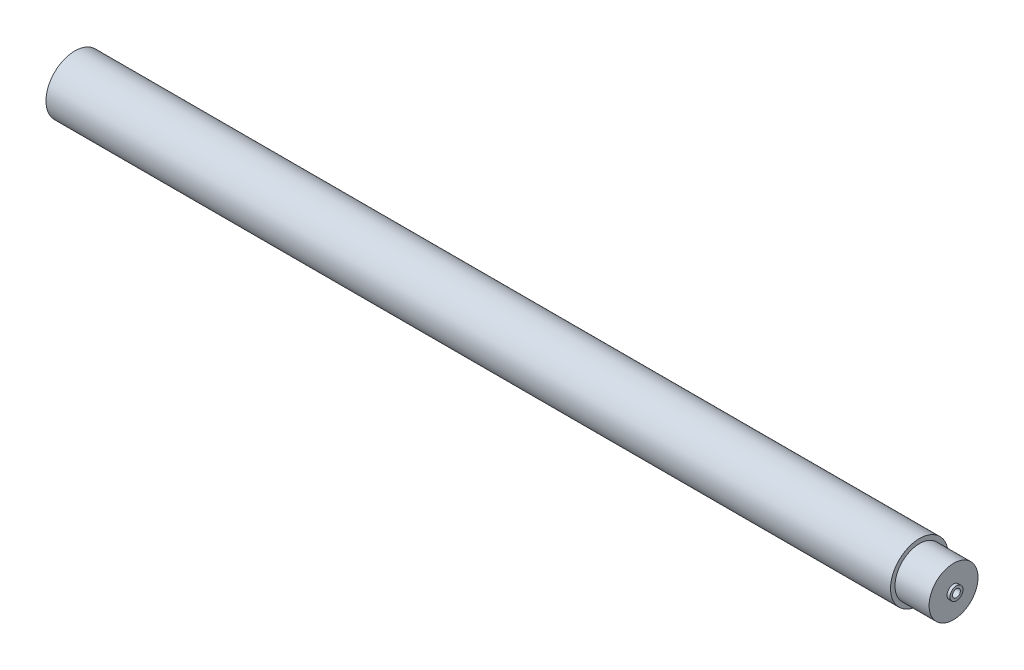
ISO-10303-21;
HEADER;
FILE_DESCRIPTION(('STEP AP214'),'2;1');
FILE_NAME('part.step','',(''),(''),'','','');
FILE_SCHEMA(('AUTOMOTIVE_DESIGN { 1 0 10303 214 1 1 1 1 }'));
ENDSEC;
DATA;
#1=APPLICATION_CONTEXT('core data for automotive mechanical design processes');
#2=APPLICATION_PROTOCOL_DEFINITION('international standard','automotive_design',2000,#1);
#3=PRODUCT_CONTEXT('',#1,'mechanical');
#4=PRODUCT('Part','Part','',(#3));
#5=PRODUCT_RELATED_PRODUCT_CATEGORY('part','',(#4));
#6=PRODUCT_DEFINITION_FORMATION('','',#4);
#7=PRODUCT_DEFINITION_CONTEXT('part definition',#1,'design');
#8=PRODUCT_DEFINITION('design','',#6,#7);
#9=PRODUCT_DEFINITION_SHAPE('','',#8);
#10=(LENGTH_UNIT() NAMED_UNIT(*) SI_UNIT(.MILLI.,.METRE.));
#11=(NAMED_UNIT(*) PLANE_ANGLE_UNIT() SI_UNIT($,.RADIAN.));
#12=(NAMED_UNIT(*) SI_UNIT($,.STERADIAN.) SOLID_ANGLE_UNIT());
#13=UNCERTAINTY_MEASURE_WITH_UNIT(LENGTH_MEASURE(1.E-05),#10,'distance_accuracy_value','');
#14=(GEOMETRIC_REPRESENTATION_CONTEXT(3) GLOBAL_UNCERTAINTY_ASSIGNED_CONTEXT((#13)) GLOBAL_UNIT_ASSIGNED_CONTEXT((#10,
#11,#12)) REPRESENTATION_CONTEXT('',''));
#15=CARTESIAN_POINT('',(0.,0.,0.));
#16=DIRECTION('',(0.,0.,1.));
#17=DIRECTION('',(1.,0.,0.));
#18=AXIS2_PLACEMENT_3D('',#15,#16,#17);
#19=CARTESIAN_POINT('',(1352.5,0.,0.));
#20=DIRECTION('',(1.,0.,0.));
#21=DIRECTION('',(0.,0.,-1.));
#22=AXIS2_PLACEMENT_3D('',#19,#20,#21);
#23=PLANE('',#22);
#24=CARTESIAN_POINT('',(1352.5,0.,0.));
#25=DIRECTION('',(1.,0.,0.));
#26=DIRECTION('',(0.,0.,-1.));
#27=AXIS2_PLACEMENT_3D('',#24,#25,#26);
#28=CIRCLE('',#27,37.65);
#29=CARTESIAN_POINT('',(1352.5,0.,-37.65));
#30=VERTEX_POINT('',#29);
#31=EDGE_CURVE('E50',#30,#30,#28,.T.);
#32=ORIENTED_EDGE('',*,*,#31,.T.);
#33=EDGE_LOOP('',(#32));
#34=FACE_BOUND('',#33,.T.);
#35=CARTESIAN_POINT('',(1352.5,0.,0.));
#36=DIRECTION('',(1.,0.,0.));
#37=DIRECTION('',(0.,0.,-1.));
#38=AXIS2_PLACEMENT_3D('',#35,#36,#37);
#39=CIRCLE('',#38,10.);
#40=CARTESIAN_POINT('',(1352.5,0.,-10.));
#41=VERTEX_POINT('',#40);
#42=EDGE_CURVE('E59',#41,#41,#39,.T.);
#43=ORIENTED_EDGE('',*,*,#42,.F.);
#44=EDGE_LOOP('',(#43));
#45=FACE_BOUND('',#44,.T.);
#46=ADVANCED_FACE('F30',(#34,#45),#23,.T.);
#47=CARTESIAN_POINT('',(1300.,0.,0.));
#48=DIRECTION('',(1.,0.,0.));
#49=DIRECTION('',(0.,0.,-1.));
#50=AXIS2_PLACEMENT_3D('',#47,#48,#49);
#51=PLANE('',#50);
#52=CARTESIAN_POINT('',(1300.,0.,0.));
#53=DIRECTION('',(1.,0.,0.));
#54=DIRECTION('',(0.,0.,-1.));
#55=AXIS2_PLACEMENT_3D('',#52,#53,#54);
#56=CIRCLE('',#55,44.5);
#57=CARTESIAN_POINT('',(1300.,0.,-44.5));
#58=VERTEX_POINT('',#57);
#59=EDGE_CURVE('E37',#58,#58,#56,.T.);
#60=ORIENTED_EDGE('',*,*,#59,.T.);
#61=EDGE_LOOP('',(#60));
#62=FACE_BOUND('',#61,.T.);
#63=CARTESIAN_POINT('',(1300.,0.,0.));
#64=DIRECTION('',(1.,0.,0.));
#65=DIRECTION('',(0.,0.,-1.));
#66=AXIS2_PLACEMENT_3D('',#63,#64,#65);
#67=CIRCLE('',#66,37.65);
#68=CARTESIAN_POINT('',(1300.,0.,-37.65));
#69=VERTEX_POINT('',#68);
#70=EDGE_CURVE('E53',#69,#69,#67,.T.);
#71=ORIENTED_EDGE('',*,*,#70,.F.);
#72=EDGE_LOOP('',(#71));
#73=FACE_BOUND('',#72,.T.);
#74=ADVANCED_FACE('F92',(#62,#73),#51,.T.);
#75=CARTESIAN_POINT('',(0.,0.,0.));
#76=DIRECTION('',(1.,0.,0.));
#77=DIRECTION('',(0.,0.,-1.));
#78=AXIS2_PLACEMENT_3D('',#75,#76,#77);
#79=PLANE('',#78);
#80=CARTESIAN_POINT('',(0.,0.,0.));
#81=DIRECTION('',(1.,0.,0.));
#82=DIRECTION('',(0.,0.,-1.));
#83=AXIS2_PLACEMENT_3D('',#80,#81,#82);
#84=CIRCLE('',#83,44.5);
#85=CARTESIAN_POINT('',(0.,0.,-44.5));
#86=VERTEX_POINT('',#85);
#87=EDGE_CURVE('E41',#86,#86,#84,.T.);
#88=ORIENTED_EDGE('',*,*,#87,.F.);
#89=EDGE_LOOP('',(#88));
#90=FACE_BOUND('',#89,.T.);
#91=CARTESIAN_POINT('',(0.,0.,0.));
#92=DIRECTION('',(1.,0.,0.));
#93=DIRECTION('',(0.,0.,-1.));
#94=AXIS2_PLACEMENT_3D('',#91,#92,#93);
#95=CIRCLE('',#94,10.);
#96=CARTESIAN_POINT('',(0.,0.,-10.));
#97=VERTEX_POINT('',#96);
#98=EDGE_CURVE('E10',#97,#97,#95,.F.);
#99=ORIENTED_EDGE('',*,*,#98,.F.);
#100=EDGE_LOOP('',(#99));
#101=FACE_BOUND('',#100,.T.);
#102=ADVANCED_FACE('F98',(#90,#101),#79,.F.);
#103=CARTESIAN_POINT('',(1300.,0.,0.));
#104=DIRECTION('',(-1.,0.,0.));
#105=DIRECTION('',(0.,0.,1.));
#106=AXIS2_PLACEMENT_3D('',#103,#104,#105);
#107=CYLINDRICAL_SURFACE('',#106,44.5);
#108=ORIENTED_EDGE('',*,*,#59,.F.);
#109=EDGE_LOOP('',(#108));
#110=FACE_BOUND('',#109,.T.);
#111=ORIENTED_EDGE('',*,*,#87,.T.);
#112=EDGE_LOOP('',(#111));
#113=FACE_BOUND('',#112,.T.);
#114=ADVANCED_FACE('F32',(#110,#113),#107,.T.);
#115=CARTESIAN_POINT('',(-3.,0.,0.));
#116=DIRECTION('',(1.,0.,0.));
#117=DIRECTION('',(0.,0.,-1.));
#118=AXIS2_PLACEMENT_3D('',#115,#116,#117);
#119=CYLINDRICAL_SURFACE('',#118,10.);
#120=CARTESIAN_POINT('',(-3.,0.,0.));
#121=DIRECTION('',(-1.,0.,0.));
#122=DIRECTION('',(0.,0.,1.));
#123=AXIS2_PLACEMENT_3D('',#120,#121,#122);
#124=CIRCLE('',#123,10.);
#125=CARTESIAN_POINT('',(-3.,0.,10.));
#126=VERTEX_POINT('',#125);
#127=EDGE_CURVE('E45',#126,#126,#124,.T.);
#128=ORIENTED_EDGE('',*,*,#127,.F.);
#129=EDGE_LOOP('',(#128));
#130=FACE_BOUND('',#129,.T.);
#131=ORIENTED_EDGE('',*,*,#98,.T.);
#132=EDGE_LOOP('',(#131));
#133=FACE_BOUND('',#132,.T.);
#134=ADVANCED_FACE('F106',(#130,#133),#119,.T.);
#135=CARTESIAN_POINT('',(-3.,0.,0.));
#136=DIRECTION('',(-1.,0.,0.));
#137=DIRECTION('',(0.,0.,1.));
#138=AXIS2_PLACEMENT_3D('',#135,#136,#137);
#139=PLANE('',#138);
#140=CARTESIAN_POINT('',(-3.,0.,0.));
#141=DIRECTION('',(-1.,0.,0.));
#142=DIRECTION('',(0.,0.,1.));
#143=AXIS2_PLACEMENT_3D('',#140,#141,#142);
#144=CIRCLE('',#143,5.);
#145=CARTESIAN_POINT('',(-3.,0.,5.));
#146=VERTEX_POINT('',#145);
#147=EDGE_CURVE('E65',#146,#146,#144,.T.);
#148=ORIENTED_EDGE('',*,*,#147,.F.);
#149=EDGE_LOOP('',(#148));
#150=FACE_BOUND('',#149,.T.);
#151=ORIENTED_EDGE('',*,*,#127,.T.);
#152=EDGE_LOOP('',(#151));
#153=FACE_BOUND('',#152,.T.);
#154=ADVANCED_FACE('F102',(#150,#153),#139,.T.);
#155=CARTESIAN_POINT('',(1352.5,0.,0.));
#156=DIRECTION('',(-1.,0.,0.));
#157=DIRECTION('',(0.,0.,1.));
#158=AXIS2_PLACEMENT_3D('',#155,#156,#157);
#159=CYLINDRICAL_SURFACE('',#158,37.65);
#160=ORIENTED_EDGE('',*,*,#31,.F.);
#161=EDGE_LOOP('',(#160));
#162=FACE_BOUND('',#161,.T.);
#163=ORIENTED_EDGE('',*,*,#70,.T.);
#164=EDGE_LOOP('',(#163));
#165=FACE_BOUND('',#164,.T.);
#166=ADVANCED_FACE('F87',(#162,#165),#159,.T.);
#167=CARTESIAN_POINT('',(1357.,0.,0.));
#168=DIRECTION('',(-1.,0.,0.));
#169=DIRECTION('',(0.,0.,1.));
#170=AXIS2_PLACEMENT_3D('',#167,#168,#169);
#171=CYLINDRICAL_SURFACE('',#170,10.);
#172=CARTESIAN_POINT('',(1357.,0.,0.));
#173=DIRECTION('',(1.,0.,0.));
#174=DIRECTION('',(0.,0.,-1.));
#175=AXIS2_PLACEMENT_3D('',#172,#173,#174);
#176=CIRCLE('',#175,10.);
#177=CARTESIAN_POINT('',(1357.,0.,-10.));
#178=VERTEX_POINT('',#177);
#179=EDGE_CURVE('E56',#178,#178,#176,.T.);
#180=ORIENTED_EDGE('',*,*,#179,.F.);
#181=EDGE_LOOP('',(#180));
#182=FACE_BOUND('',#181,.T.);
#183=ORIENTED_EDGE('',*,*,#42,.T.);
#184=EDGE_LOOP('',(#183));
#185=FACE_BOUND('',#184,.T.);
#186=ADVANCED_FACE('F81',(#182,#185),#171,.T.);
#187=CARTESIAN_POINT('',(1357.,0.,0.));
#188=DIRECTION('',(1.,0.,0.));
#189=DIRECTION('',(0.,0.,-1.));
#190=AXIS2_PLACEMENT_3D('',#187,#188,#189);
#191=PLANE('',#190);
#192=CARTESIAN_POINT('',(1357.,0.,0.));
#193=DIRECTION('',(1.,0.,0.));
#194=DIRECTION('',(0.,0.,-1.));
#195=AXIS2_PLACEMENT_3D('',#192,#193,#194);
#196=CIRCLE('',#195,6.);
#197=CARTESIAN_POINT('',(1357.,0.,-6.));
#198=VERTEX_POINT('',#197);
#199=EDGE_CURVE('E71',#198,#198,#196,.T.);
#200=ORIENTED_EDGE('',*,*,#199,.F.);
#201=EDGE_LOOP('',(#200));
#202=FACE_BOUND('',#201,.T.);
#203=ORIENTED_EDGE('',*,*,#179,.T.);
#204=EDGE_LOOP('',(#203));
#205=FACE_BOUND('',#204,.T.);
#206=ADVANCED_FACE('F77',(#202,#205),#191,.T.);
#207=CARTESIAN_POINT('',(27.,0.,0.));
#208=DIRECTION('',(-1.,0.,0.));
#209=DIRECTION('',(0.,0.,1.));
#210=AXIS2_PLACEMENT_3D('',#207,#208,#209);
#211=CYLINDRICAL_SURFACE('',#210,5.);
#212=CARTESIAN_POINT('',(27.,0.,0.));
#213=DIRECTION('',(-1.,0.,0.));
#214=DIRECTION('',(0.,0.,1.));
#215=AXIS2_PLACEMENT_3D('',#212,#213,#214);
#216=CIRCLE('',#215,5.);
#217=CARTESIAN_POINT('',(27.,0.,5.));
#218=VERTEX_POINT('',#217);
#219=EDGE_CURVE('E62',#218,#218,#216,.T.);
#220=ORIENTED_EDGE('',*,*,#219,.F.);
#221=EDGE_LOOP('',(#220));
#222=FACE_BOUND('',#221,.T.);
#223=ORIENTED_EDGE('',*,*,#147,.T.);
#224=EDGE_LOOP('',(#223));
#225=FACE_BOUND('',#224,.T.);
#226=ADVANCED_FACE('F80',(#222,#225),#211,.F.);
#227=CARTESIAN_POINT('',(27.,0.,0.));
#228=DIRECTION('',(-1.,0.,0.));
#229=DIRECTION('',(0.,0.,1.));
#230=AXIS2_PLACEMENT_3D('',#227,#228,#229);
#231=PLANE('',#230);
#232=ORIENTED_EDGE('',*,*,#219,.T.);
#233=EDGE_LOOP('',(#232));
#234=FACE_BOUND('',#233,.T.);
#235=ADVANCED_FACE('F151',(#234),#231,.T.);
#236=CARTESIAN_POINT('',(1327.,0.,0.));
#237=DIRECTION('',(1.,0.,0.));
#238=DIRECTION('',(0.,0.,-1.));
#239=AXIS2_PLACEMENT_3D('',#236,#237,#238);
#240=CYLINDRICAL_SURFACE('',#239,6.);
#241=CARTESIAN_POINT('',(1327.,0.,0.));
#242=DIRECTION('',(1.,0.,0.));
#243=DIRECTION('',(0.,0.,-1.));
#244=AXIS2_PLACEMENT_3D('',#241,#242,#243);
#245=CIRCLE('',#244,6.);
#246=CARTESIAN_POINT('',(1327.,0.,-6.));
#247=VERTEX_POINT('',#246);
#248=EDGE_CURVE('E68',#247,#247,#245,.T.);
#249=ORIENTED_EDGE('',*,*,#248,.F.);
#250=EDGE_LOOP('',(#249));
#251=FACE_BOUND('',#250,.T.);
#252=ORIENTED_EDGE('',*,*,#199,.T.);
#253=EDGE_LOOP('',(#252));
#254=FACE_BOUND('',#253,.T.);
#255=ADVANCED_FACE('F75',(#251,#254),#240,.F.);
#256=CARTESIAN_POINT('',(1327.,0.,0.));
#257=DIRECTION('',(1.,0.,0.));
#258=DIRECTION('',(0.,0.,-1.));
#259=AXIS2_PLACEMENT_3D('',#256,#257,#258);
#260=PLANE('',#259);
#261=ORIENTED_EDGE('',*,*,#248,.T.);
#262=EDGE_LOOP('',(#261));
#263=FACE_BOUND('',#262,.T.);
#264=ADVANCED_FACE('F164',(#263),#260,.T.);
#265=CLOSED_SHELL('',(#46,#74,#102,#114,#134,#154,#166,#186,#206,#226,#235,#255,#264));
#266=MANIFOLD_SOLID_BREP('B2',#265);
#267=ADVANCED_BREP_SHAPE_REPRESENTATION('',(#18,#266),#14);
#268=SHAPE_DEFINITION_REPRESENTATION(#9,#267);
ENDSEC;
END-ISO-10303-21;
